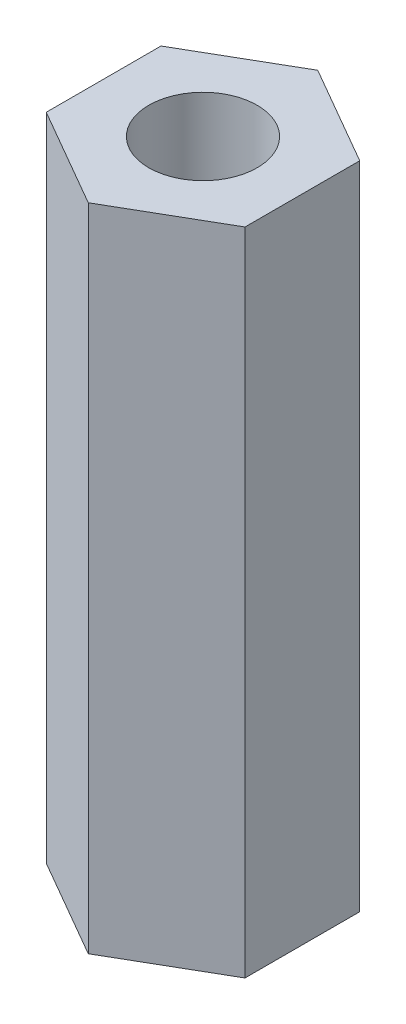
ISO-10303-21;
HEADER;
FILE_DESCRIPTION(('STEP AP214'),'2;1');
FILE_NAME('part.step','',(''),(''),'','','');
FILE_SCHEMA(('AUTOMOTIVE_DESIGN { 1 0 10303 214 1 1 1 1 }'));
ENDSEC;
DATA;
#1=APPLICATION_CONTEXT('core data for automotive mechanical design processes');
#2=APPLICATION_PROTOCOL_DEFINITION('international standard','automotive_design',2000,#1);
#3=PRODUCT_CONTEXT('',#1,'mechanical');
#4=PRODUCT('Part','Part','',(#3));
#5=PRODUCT_RELATED_PRODUCT_CATEGORY('part','',(#4));
#6=PRODUCT_DEFINITION_FORMATION('','',#4);
#7=PRODUCT_DEFINITION_CONTEXT('part definition',#1,'design');
#8=PRODUCT_DEFINITION('design','',#6,#7);
#9=PRODUCT_DEFINITION_SHAPE('','',#8);
#10=(LENGTH_UNIT() NAMED_UNIT(*) SI_UNIT(.MILLI.,.METRE.));
#11=(NAMED_UNIT(*) PLANE_ANGLE_UNIT() SI_UNIT($,.RADIAN.));
#12=(NAMED_UNIT(*) SI_UNIT($,.STERADIAN.) SOLID_ANGLE_UNIT());
#13=UNCERTAINTY_MEASURE_WITH_UNIT(LENGTH_MEASURE(1.E-05),#10,'distance_accuracy_value','');
#14=(GEOMETRIC_REPRESENTATION_CONTEXT(3) GLOBAL_UNCERTAINTY_ASSIGNED_CONTEXT((#13)) GLOBAL_UNIT_ASSIGNED_CONTEXT((#10,
#11,#12)) REPRESENTATION_CONTEXT('',''));
#15=CARTESIAN_POINT('',(0.,0.,0.));
#16=DIRECTION('',(0.,0.,1.));
#17=DIRECTION('',(1.,0.,0.));
#18=AXIS2_PLACEMENT_3D('',#15,#16,#17);
#19=CARTESIAN_POINT('',(0.,18.,0.));
#20=DIRECTION('',(0.,1.,0.));
#21=DIRECTION('',(0.,0.,1.));
#22=AXIS2_PLACEMENT_3D('',#19,#20,#21);
#23=PLANE('',#22);
#24=DIRECTION('',(0.,0.,-1.));
#25=VECTOR('',#24,1.);
#26=CARTESIAN_POINT('',(2.75,18.,1.58771324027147));
#27=LINE('',#26,#25);
#28=CARTESIAN_POINT('',(2.75,18.,1.58771324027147));
#29=VERTEX_POINT('',#28);
#30=CARTESIAN_POINT('',(2.75,18.,-1.58771324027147));
#31=VERTEX_POINT('',#30);
#32=EDGE_CURVE('E146',#29,#31,#27,.T.);
#33=ORIENTED_EDGE('',*,*,#32,.T.);
#34=DIRECTION('',(-0.866025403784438,0.,-0.5));
#35=VECTOR('',#34,1.);
#36=CARTESIAN_POINT('',(2.75,18.,-1.58771324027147));
#37=LINE('',#36,#35);
#38=CARTESIAN_POINT('',(0.,18.,-3.17542648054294));
#39=VERTEX_POINT('',#38);
#40=EDGE_CURVE('E94',#31,#39,#37,.T.);
#41=ORIENTED_EDGE('',*,*,#40,.T.);
#42=DIRECTION('',(-0.866025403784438,0.,0.5));
#43=VECTOR('',#42,1.);
#44=CARTESIAN_POINT('',(0.,18.,-3.17542648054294));
#45=LINE('',#44,#43);
#46=CARTESIAN_POINT('',(-2.75,18.,-1.58771324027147));
#47=VERTEX_POINT('',#46);
#48=EDGE_CURVE('E107',#39,#47,#45,.T.);
#49=ORIENTED_EDGE('',*,*,#48,.T.);
#50=DIRECTION('',(0.,0.,1.));
#51=VECTOR('',#50,1.);
#52=CARTESIAN_POINT('',(-2.75,18.,-1.58771324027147));
#53=LINE('',#52,#51);
#54=CARTESIAN_POINT('',(-2.75,18.,1.58771324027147));
#55=VERTEX_POINT('',#54);
#56=EDGE_CURVE('E101',#47,#55,#53,.T.);
#57=ORIENTED_EDGE('',*,*,#56,.T.);
#58=DIRECTION('',(0.866025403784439,0.,0.5));
#59=VECTOR('',#58,1.);
#60=CARTESIAN_POINT('',(-2.75,18.,1.58771324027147));
#61=LINE('',#60,#59);
#62=CARTESIAN_POINT('',(0.,18.,3.17542648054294));
#63=VERTEX_POINT('',#62);
#64=EDGE_CURVE('E105',#55,#63,#61,.T.);
#65=ORIENTED_EDGE('',*,*,#64,.T.);
#66=DIRECTION('',(0.866025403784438,0.,-0.5));
#67=VECTOR('',#66,1.);
#68=CARTESIAN_POINT('',(0.,18.,3.17542648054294));
#69=LINE('',#68,#67);
#70=EDGE_CURVE('E57',#63,#29,#69,.T.);
#71=ORIENTED_EDGE('',*,*,#70,.T.);
#72=EDGE_LOOP('',(#33,#41,#49,#57,#65,#71));
#73=FACE_BOUND('',#72,.T.);
#74=CARTESIAN_POINT('',(0.,18.,0.));
#75=DIRECTION('',(0.,1.,0.));
#76=DIRECTION('',(0.,0.,1.));
#77=AXIS2_PLACEMENT_3D('',#74,#75,#76);
#78=CIRCLE('',#77,1.5);
#79=CARTESIAN_POINT('',(0.,18.,1.5));
#80=VERTEX_POINT('',#79);
#81=EDGE_CURVE('E134',#80,#80,#78,.T.);
#82=ORIENTED_EDGE('',*,*,#81,.F.);
#83=EDGE_LOOP('',(#82));
#84=FACE_BOUND('',#83,.T.);
#85=ADVANCED_FACE('F39',(#73,#84),#23,.T.);
#86=CARTESIAN_POINT('',(0.,0.,0.));
#87=DIRECTION('',(0.,1.,0.));
#88=DIRECTION('',(0.,0.,1.));
#89=AXIS2_PLACEMENT_3D('',#86,#87,#88);
#90=PLANE('',#89);
#91=DIRECTION('',(0.,0.,-1.));
#92=VECTOR('',#91,1.);
#93=CARTESIAN_POINT('',(2.75,0.,1.58771324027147));
#94=LINE('',#93,#92);
#95=CARTESIAN_POINT('',(2.75,0.,1.58771324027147));
#96=VERTEX_POINT('',#95);
#97=CARTESIAN_POINT('',(2.75,0.,-1.58771324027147));
#98=VERTEX_POINT('',#97);
#99=EDGE_CURVE('E129',#96,#98,#94,.T.);
#100=ORIENTED_EDGE('',*,*,#99,.F.);
#101=DIRECTION('',(0.866025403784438,0.,-0.5));
#102=VECTOR('',#101,1.);
#103=CARTESIAN_POINT('',(0.,0.,3.17542648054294));
#104=LINE('',#103,#102);
#105=CARTESIAN_POINT('',(0.,0.,3.17542648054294));
#106=VERTEX_POINT('',#105);
#107=EDGE_CURVE('E86',#106,#96,#104,.T.);
#108=ORIENTED_EDGE('',*,*,#107,.F.);
#109=DIRECTION('',(0.866025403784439,0.,0.5));
#110=VECTOR('',#109,1.);
#111=CARTESIAN_POINT('',(-2.75,0.,1.58771324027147));
#112=LINE('',#111,#110);
#113=CARTESIAN_POINT('',(-2.75,0.,1.58771324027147));
#114=VERTEX_POINT('',#113);
#115=EDGE_CURVE('E80',#114,#106,#112,.T.);
#116=ORIENTED_EDGE('',*,*,#115,.F.);
#117=DIRECTION('',(0.,0.,1.));
#118=VECTOR('',#117,1.);
#119=CARTESIAN_POINT('',(-2.75,0.,-1.58771324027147));
#120=LINE('',#119,#118);
#121=CARTESIAN_POINT('',(-2.75,0.,-1.58771324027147));
#122=VERTEX_POINT('',#121);
#123=EDGE_CURVE('E116',#122,#114,#120,.T.);
#124=ORIENTED_EDGE('',*,*,#123,.F.);
#125=DIRECTION('',(-0.866025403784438,0.,0.5));
#126=VECTOR('',#125,1.);
#127=CARTESIAN_POINT('',(0.,0.,-3.17542648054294));
#128=LINE('',#127,#126);
#129=CARTESIAN_POINT('',(0.,0.,-3.17542648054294));
#130=VERTEX_POINT('',#129);
#131=EDGE_CURVE('E137',#130,#122,#128,.T.);
#132=ORIENTED_EDGE('',*,*,#131,.F.);
#133=DIRECTION('',(-0.866025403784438,0.,-0.5));
#134=VECTOR('',#133,1.);
#135=CARTESIAN_POINT('',(2.75,0.,-1.58771324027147));
#136=LINE('',#135,#134);
#137=EDGE_CURVE('E133',#98,#130,#136,.T.);
#138=ORIENTED_EDGE('',*,*,#137,.F.);
#139=EDGE_LOOP('',(#100,#108,#116,#124,#132,#138));
#140=FACE_BOUND('',#139,.T.);
#141=CARTESIAN_POINT('',(0.,0.,0.));
#142=DIRECTION('',(0.,1.,0.));
#143=DIRECTION('',(0.,0.,1.));
#144=AXIS2_PLACEMENT_3D('',#141,#142,#143);
#145=CIRCLE('',#144,1.5);
#146=CARTESIAN_POINT('',(0.,0.,1.5));
#147=VERTEX_POINT('',#146);
#148=EDGE_CURVE('E243',#147,#147,#145,.T.);
#149=ORIENTED_EDGE('',*,*,#148,.T.);
#150=EDGE_LOOP('',(#149));
#151=FACE_BOUND('',#150,.T.);
#152=ADVANCED_FACE('F159',(#140,#151),#90,.F.);
#153=CARTESIAN_POINT('',(2.75,18.,1.58771324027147));
#154=DIRECTION('',(-1.,0.,0.));
#155=DIRECTION('',(0.,0.,1.));
#156=AXIS2_PLACEMENT_3D('',#153,#154,#155);
#157=PLANE('',#156);
#158=ORIENTED_EDGE('',*,*,#99,.T.);
#159=DIRECTION('',(0.,-1.,0.));
#160=VECTOR('',#159,1.);
#161=CARTESIAN_POINT('',(2.75,18.,-1.58771324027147));
#162=LINE('',#161,#160);
#163=EDGE_CURVE('E11',#31,#98,#162,.T.);
#164=ORIENTED_EDGE('',*,*,#163,.F.);
#165=ORIENTED_EDGE('',*,*,#32,.F.);
#166=DIRECTION('',(0.,-1.,0.));
#167=VECTOR('',#166,1.);
#168=CARTESIAN_POINT('',(2.75,18.,1.58771324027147));
#169=LINE('',#168,#167);
#170=EDGE_CURVE('E125',#29,#96,#169,.T.);
#171=ORIENTED_EDGE('',*,*,#170,.T.);
#172=EDGE_LOOP('',(#158,#164,#165,#171));
#173=FACE_BOUND('',#172,.T.);
#174=ADVANCED_FACE('F41',(#173),#157,.F.);
#175=CARTESIAN_POINT('',(2.75,18.,-1.58771324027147));
#176=DIRECTION('',(-0.5,0.,0.866025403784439));
#177=DIRECTION('',(0.866025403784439,0.,0.5));
#178=AXIS2_PLACEMENT_3D('',#175,#176,#177);
#179=PLANE('',#178);
#180=ORIENTED_EDGE('',*,*,#137,.T.);
#181=DIRECTION('',(0.,-1.,0.));
#182=VECTOR('',#181,1.);
#183=CARTESIAN_POINT('',(0.,18.,-3.17542648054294));
#184=LINE('',#183,#182);
#185=EDGE_CURVE('E49',#39,#130,#184,.T.);
#186=ORIENTED_EDGE('',*,*,#185,.F.);
#187=ORIENTED_EDGE('',*,*,#40,.F.);
#188=ORIENTED_EDGE('',*,*,#163,.T.);
#189=EDGE_LOOP('',(#180,#186,#187,#188));
#190=FACE_BOUND('',#189,.T.);
#191=ADVANCED_FACE('F184',(#190),#179,.F.);
#192=CARTESIAN_POINT('',(0.,18.,-3.17542648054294));
#193=DIRECTION('',(0.5,0.,0.866025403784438));
#194=DIRECTION('',(0.866025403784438,0.,-0.500000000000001));
#195=AXIS2_PLACEMENT_3D('',#192,#193,#194);
#196=PLANE('',#195);
#197=ORIENTED_EDGE('',*,*,#131,.T.);
#198=DIRECTION('',(0.,-1.,0.));
#199=VECTOR('',#198,1.);
#200=CARTESIAN_POINT('',(-2.75,18.,-1.58771324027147));
#201=LINE('',#200,#199);
#202=EDGE_CURVE('E118',#47,#122,#201,.T.);
#203=ORIENTED_EDGE('',*,*,#202,.F.);
#204=ORIENTED_EDGE('',*,*,#48,.F.);
#205=ORIENTED_EDGE('',*,*,#185,.T.);
#206=EDGE_LOOP('',(#197,#203,#204,#205));
#207=FACE_BOUND('',#206,.T.);
#208=ADVANCED_FACE('F156',(#207),#196,.F.);
#209=CARTESIAN_POINT('',(-2.75,18.,-1.58771324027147));
#210=DIRECTION('',(1.,0.,0.));
#211=DIRECTION('',(0.,0.,-1.));
#212=AXIS2_PLACEMENT_3D('',#209,#210,#211);
#213=PLANE('',#212);
#214=ORIENTED_EDGE('',*,*,#123,.T.);
#215=DIRECTION('',(0.,-1.,0.));
#216=VECTOR('',#215,1.);
#217=CARTESIAN_POINT('',(-2.75,18.,1.58771324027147));
#218=LINE('',#217,#216);
#219=EDGE_CURVE('E113',#55,#114,#218,.T.);
#220=ORIENTED_EDGE('',*,*,#219,.F.);
#221=ORIENTED_EDGE('',*,*,#56,.F.);
#222=ORIENTED_EDGE('',*,*,#202,.T.);
#223=EDGE_LOOP('',(#214,#220,#221,#222));
#224=FACE_BOUND('',#223,.T.);
#225=ADVANCED_FACE('F114',(#224),#213,.F.);
#226=CARTESIAN_POINT('',(-2.75,18.,1.58771324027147));
#227=DIRECTION('',(0.5,0.,-0.866025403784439));
#228=DIRECTION('',(-0.866025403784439,0.,-0.5));
#229=AXIS2_PLACEMENT_3D('',#226,#227,#228);
#230=PLANE('',#229);
#231=ORIENTED_EDGE('',*,*,#115,.T.);
#232=DIRECTION('',(0.,-1.,0.));
#233=VECTOR('',#232,1.);
#234=CARTESIAN_POINT('',(0.,18.,3.17542648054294));
#235=LINE('',#234,#233);
#236=EDGE_CURVE('E119',#63,#106,#235,.T.);
#237=ORIENTED_EDGE('',*,*,#236,.F.);
#238=ORIENTED_EDGE('',*,*,#64,.F.);
#239=ORIENTED_EDGE('',*,*,#219,.T.);
#240=EDGE_LOOP('',(#231,#237,#238,#239));
#241=FACE_BOUND('',#240,.T.);
#242=ADVANCED_FACE('F121',(#241),#230,.F.);
#243=CARTESIAN_POINT('',(0.,18.,3.17542648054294));
#244=DIRECTION('',(-0.5,0.,-0.866025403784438));
#245=DIRECTION('',(-0.866025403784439,0.,0.5));
#246=AXIS2_PLACEMENT_3D('',#243,#244,#245);
#247=PLANE('',#246);
#248=ORIENTED_EDGE('',*,*,#107,.T.);
#249=ORIENTED_EDGE('',*,*,#170,.F.);
#250=ORIENTED_EDGE('',*,*,#70,.F.);
#251=ORIENTED_EDGE('',*,*,#236,.T.);
#252=EDGE_LOOP('',(#248,#249,#250,#251));
#253=FACE_BOUND('',#252,.T.);
#254=ADVANCED_FACE('F164',(#253),#247,.F.);
#255=CARTESIAN_POINT('',(0.,18.,0.));
#256=DIRECTION('',(0.,-1.,0.));
#257=DIRECTION('',(0.,0.,-1.));
#258=AXIS2_PLACEMENT_3D('',#255,#256,#257);
#259=CYLINDRICAL_SURFACE('',#258,1.5);
#260=ORIENTED_EDGE('',*,*,#81,.T.);
#261=EDGE_LOOP('',(#260));
#262=FACE_BOUND('',#261,.T.);
#263=ORIENTED_EDGE('',*,*,#148,.F.);
#264=EDGE_LOOP('',(#263));
#265=FACE_BOUND('',#264,.T.);
#266=ADVANCED_FACE('F166',(#262,#265),#259,.F.);
#267=CLOSED_SHELL('',(#85,#152,#174,#191,#208,#225,#242,#254,#266));
#268=MANIFOLD_SOLID_BREP('B2',#267);
#269=ADVANCED_BREP_SHAPE_REPRESENTATION('',(#18,#268),#14);
#270=SHAPE_DEFINITION_REPRESENTATION(#9,#269);
ENDSEC;
END-ISO-10303-21;
